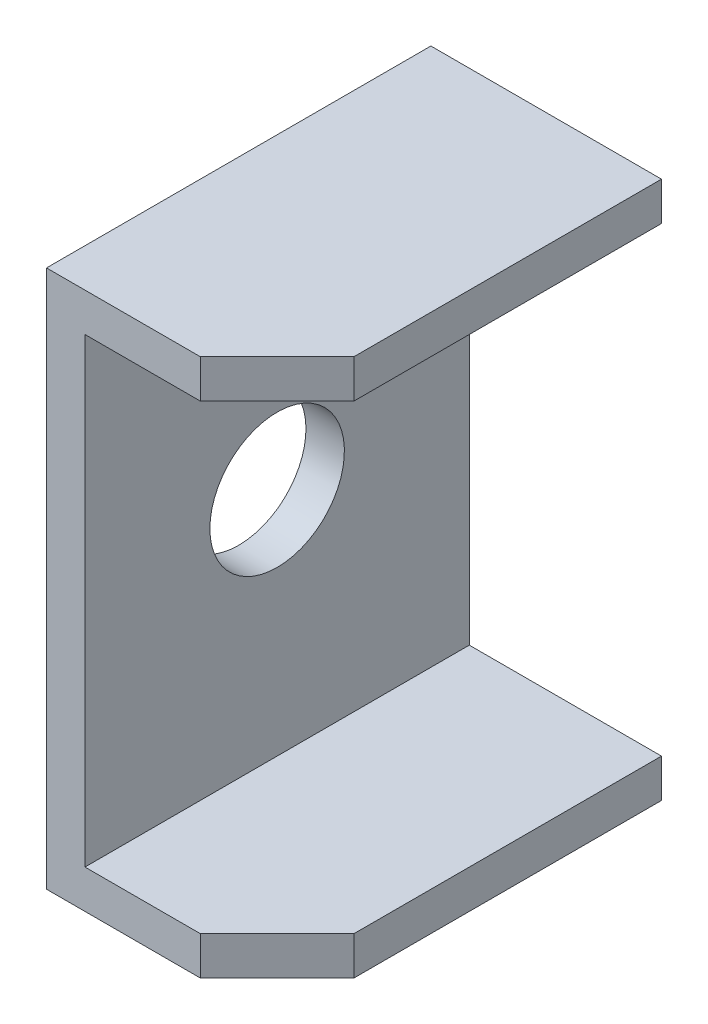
ISO-10303-21;
HEADER;
FILE_DESCRIPTION(('STEP AP214'),'2;1');
FILE_NAME('part.step','',(''),(''),'','','');
FILE_SCHEMA(('AUTOMOTIVE_DESIGN { 1 0 10303 214 1 1 1 1 }'));
ENDSEC;
DATA;
#1=APPLICATION_CONTEXT('core data for automotive mechanical design processes');
#2=APPLICATION_PROTOCOL_DEFINITION('international standard','automotive_design',2000,#1);
#3=PRODUCT_CONTEXT('',#1,'mechanical');
#4=PRODUCT('Part','Part','',(#3));
#5=PRODUCT_RELATED_PRODUCT_CATEGORY('part','',(#4));
#6=PRODUCT_DEFINITION_FORMATION('','',#4);
#7=PRODUCT_DEFINITION_CONTEXT('part definition',#1,'design');
#8=PRODUCT_DEFINITION('design','',#6,#7);
#9=PRODUCT_DEFINITION_SHAPE('','',#8);
#10=(LENGTH_UNIT() NAMED_UNIT(*) SI_UNIT(.MILLI.,.METRE.));
#11=(NAMED_UNIT(*) PLANE_ANGLE_UNIT() SI_UNIT($,.RADIAN.));
#12=(NAMED_UNIT(*) SI_UNIT($,.STERADIAN.) SOLID_ANGLE_UNIT());
#13=UNCERTAINTY_MEASURE_WITH_UNIT(LENGTH_MEASURE(1.E-05),#10,'distance_accuracy_value','');
#14=(GEOMETRIC_REPRESENTATION_CONTEXT(3) GLOBAL_UNCERTAINTY_ASSIGNED_CONTEXT((#13)) GLOBAL_UNIT_ASSIGNED_CONTEXT((#10,
#11,#12)) REPRESENTATION_CONTEXT('',''));
#15=CARTESIAN_POINT('',(0.,0.,0.));
#16=DIRECTION('',(0.,0.,1.));
#17=DIRECTION('',(1.,0.,0.));
#18=AXIS2_PLACEMENT_3D('',#15,#16,#17);
#19=CARTESIAN_POINT('',(0.,0.,100.));
#20=DIRECTION('',(1.,0.,0.));
#21=DIRECTION('',(0.,1.,0.));
#22=AXIS2_PLACEMENT_3D('',#19,#20,#21);
#23=PLANE('',#22);
#24=CARTESIAN_POINT('',(0.,-70.,50.));
#25=DIRECTION('',(-1.,0.,0.));
#26=DIRECTION('',(0.,-1.,0.));
#27=AXIS2_PLACEMENT_3D('',#24,#25,#26);
#28=CIRCLE('',#27,17.5);
#29=CARTESIAN_POINT('',(0.,-87.5,50.));
#30=VERTEX_POINT('',#29);
#31=EDGE_CURVE('E132',#30,#30,#28,.T.);
#32=ORIENTED_EDGE('',*,*,#31,.F.);
#33=EDGE_LOOP('',(#32));
#34=FACE_BOUND('',#33,.T.);
#35=DIRECTION('',(0.,-1.,0.));
#36=VECTOR('',#35,1.);
#37=CARTESIAN_POINT('',(0.,0.,0.));
#38=LINE('',#37,#36);
#39=CARTESIAN_POINT('',(0.,0.,0.));
#40=VERTEX_POINT('',#39);
#41=CARTESIAN_POINT('',(0.,-140.,0.));
#42=VERTEX_POINT('',#41);
#43=EDGE_CURVE('E109',#40,#42,#38,.T.);
#44=ORIENTED_EDGE('',*,*,#43,.T.);
#45=DIRECTION('',(0.,0.,-1.));
#46=VECTOR('',#45,1.);
#47=CARTESIAN_POINT('',(0.,-140.,100.));
#48=LINE('',#47,#46);
#49=CARTESIAN_POINT('',(0.,-140.,100.));
#50=VERTEX_POINT('',#49);
#51=EDGE_CURVE('E116',#50,#42,#48,.T.);
#52=ORIENTED_EDGE('',*,*,#51,.F.);
#53=DIRECTION('',(0.,-1.,0.));
#54=VECTOR('',#53,1.);
#55=CARTESIAN_POINT('',(0.,0.,100.));
#56=LINE('',#55,#54);
#57=CARTESIAN_POINT('',(0.,0.,100.));
#58=VERTEX_POINT('',#57);
#59=EDGE_CURVE('E149',#58,#50,#56,.T.);
#60=ORIENTED_EDGE('',*,*,#59,.F.);
#61=DIRECTION('',(0.,0.,-1.));
#62=VECTOR('',#61,1.);
#63=CARTESIAN_POINT('',(0.,0.,100.));
#64=LINE('',#63,#62);
#65=EDGE_CURVE('E128',#58,#40,#64,.T.);
#66=ORIENTED_EDGE('',*,*,#65,.T.);
#67=EDGE_LOOP('',(#44,#52,#60,#66));
#68=FACE_BOUND('',#67,.T.);
#69=ADVANCED_FACE('F29',(#34,#68),#23,.F.);
#70=CARTESIAN_POINT('',(0.,-140.,100.));
#71=DIRECTION('',(0.,1.,0.));
#72=DIRECTION('',(-1.,0.,0.));
#73=AXIS2_PLACEMENT_3D('',#70,#71,#72);
#74=PLANE('',#73);
#75=DIRECTION('',(0.,0.,-1.));
#76=VECTOR('',#75,1.);
#77=CARTESIAN_POINT('',(60.,-140.,100.));
#78=LINE('',#77,#76);
#79=CARTESIAN_POINT('',(60.,-140.,79.9999999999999));
#80=VERTEX_POINT('',#79);
#81=CARTESIAN_POINT('',(60.,-140.,0.));
#82=VERTEX_POINT('',#81);
#83=EDGE_CURVE('E124',#80,#82,#78,.T.);
#84=ORIENTED_EDGE('',*,*,#83,.F.);
#85=DIRECTION('',(0.707106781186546,0.,-0.707106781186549));
#86=VECTOR('',#85,1.);
#87=CARTESIAN_POINT('',(40.,-140.,100.));
#88=LINE('',#87,#86);
#89=CARTESIAN_POINT('',(40.,-140.,100.));
#90=VERTEX_POINT('',#89);
#91=EDGE_CURVE('E11',#80,#90,#88,.F.);
#92=ORIENTED_EDGE('',*,*,#91,.T.);
#93=DIRECTION('',(1.,0.,0.));
#94=VECTOR('',#93,1.);
#95=CARTESIAN_POINT('',(0.,-140.,100.));
#96=LINE('',#95,#94);
#97=EDGE_CURVE('E119',#50,#90,#96,.T.);
#98=ORIENTED_EDGE('',*,*,#97,.F.);
#99=ORIENTED_EDGE('',*,*,#51,.T.);
#100=DIRECTION('',(1.,0.,0.));
#101=VECTOR('',#100,1.);
#102=CARTESIAN_POINT('',(0.,-140.,0.));
#103=LINE('',#102,#101);
#104=EDGE_CURVE('E104',#42,#82,#103,.T.);
#105=ORIENTED_EDGE('',*,*,#104,.T.);
#106=EDGE_LOOP('',(#84,#92,#98,#99,#105));
#107=FACE_BOUND('',#106,.T.);
#108=ADVANCED_FACE('F117',(#107),#74,.F.);
#109=CARTESIAN_POINT('',(60.,-140.,100.));
#110=DIRECTION('',(-1.,0.,0.));
#111=DIRECTION('',(0.,0.,1.));
#112=AXIS2_PLACEMENT_3D('',#109,#110,#111);
#113=PLANE('',#112);
#114=DIRECTION('',(0.,0.,-1.));
#115=VECTOR('',#114,1.);
#116=CARTESIAN_POINT('',(60.,-130.,100.));
#117=LINE('',#116,#115);
#118=CARTESIAN_POINT('',(60.,-130.,79.9999999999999));
#119=VERTEX_POINT('',#118);
#120=CARTESIAN_POINT('',(60.,-130.,0.));
#121=VERTEX_POINT('',#120);
#122=EDGE_CURVE('E172',#119,#121,#117,.T.);
#123=ORIENTED_EDGE('',*,*,#122,.F.);
#124=DIRECTION('',(0.,-1.,0.));
#125=VECTOR('',#124,1.);
#126=CARTESIAN_POINT('',(60.,-140.,79.9999999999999));
#127=LINE('',#126,#125);
#128=EDGE_CURVE('E36',#119,#80,#127,.T.);
#129=ORIENTED_EDGE('',*,*,#128,.T.);
#130=ORIENTED_EDGE('',*,*,#83,.T.);
#131=DIRECTION('',(0.,1.,0.));
#132=VECTOR('',#131,1.);
#133=CARTESIAN_POINT('',(60.,-140.,0.));
#134=LINE('',#133,#132);
#135=EDGE_CURVE('E112',#82,#121,#134,.T.);
#136=ORIENTED_EDGE('',*,*,#135,.T.);
#137=EDGE_LOOP('',(#123,#129,#130,#136));
#138=FACE_BOUND('',#137,.T.);
#139=ADVANCED_FACE('F211',(#138),#113,.F.);
#140=CARTESIAN_POINT('',(60.,-130.,100.));
#141=DIRECTION('',(0.,-1.,0.));
#142=DIRECTION('',(0.,0.,-1.));
#143=AXIS2_PLACEMENT_3D('',#140,#141,#142);
#144=PLANE('',#143);
#145=DIRECTION('',(-1.,0.,0.));
#146=VECTOR('',#145,1.);
#147=CARTESIAN_POINT('',(60.,-130.,100.));
#148=LINE('',#147,#146);
#149=CARTESIAN_POINT('',(40.,-130.,100.));
#150=VERTEX_POINT('',#149);
#151=CARTESIAN_POINT('',(10.,-130.,100.));
#152=VERTEX_POINT('',#151);
#153=EDGE_CURVE('E152',#150,#152,#148,.T.);
#154=ORIENTED_EDGE('',*,*,#153,.F.);
#155=DIRECTION('',(-0.707106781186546,0.,0.707106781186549));
#156=VECTOR('',#155,1.);
#157=CARTESIAN_POINT('',(40.,-130.,100.));
#158=LINE('',#157,#156);
#159=EDGE_CURVE('E50',#150,#119,#158,.F.);
#160=ORIENTED_EDGE('',*,*,#159,.T.);
#161=ORIENTED_EDGE('',*,*,#122,.T.);
#162=DIRECTION('',(-1.,0.,0.));
#163=VECTOR('',#162,1.);
#164=CARTESIAN_POINT('',(60.,-130.,0.));
#165=LINE('',#164,#163);
#166=CARTESIAN_POINT('',(10.,-130.,0.));
#167=VERTEX_POINT('',#166);
#168=EDGE_CURVE('E137',#121,#167,#165,.T.);
#169=ORIENTED_EDGE('',*,*,#168,.T.);
#170=DIRECTION('',(0.,0.,-1.));
#171=VECTOR('',#170,1.);
#172=CARTESIAN_POINT('',(10.,-130.,100.));
#173=LINE('',#172,#171);
#174=EDGE_CURVE('E169',#152,#167,#173,.T.);
#175=ORIENTED_EDGE('',*,*,#174,.F.);
#176=EDGE_LOOP('',(#154,#160,#161,#169,#175));
#177=FACE_BOUND('',#176,.T.);
#178=ADVANCED_FACE('F214',(#177),#144,.F.);
#179=CARTESIAN_POINT('',(10.,-130.,100.));
#180=DIRECTION('',(-1.,0.,0.));
#181=DIRECTION('',(0.,0.,1.));
#182=AXIS2_PLACEMENT_3D('',#179,#180,#181);
#183=PLANE('',#182);
#184=CARTESIAN_POINT('',(10.,-70.,50.));
#185=DIRECTION('',(-1.,0.,0.));
#186=DIRECTION('',(0.,0.,1.));
#187=AXIS2_PLACEMENT_3D('',#184,#185,#186);
#188=CIRCLE('',#187,17.5);
#189=CARTESIAN_POINT('',(10.,-70.,67.5));
#190=VERTEX_POINT('',#189);
#191=EDGE_CURVE('E129',#190,#190,#188,.T.);
#192=ORIENTED_EDGE('',*,*,#191,.T.);
#193=EDGE_LOOP('',(#192));
#194=FACE_BOUND('',#193,.T.);
#195=DIRECTION('',(0.,1.,0.));
#196=VECTOR('',#195,1.);
#197=CARTESIAN_POINT('',(10.,-130.,0.));
#198=LINE('',#197,#196);
#199=CARTESIAN_POINT('',(10.,-10.,0.));
#200=VERTEX_POINT('',#199);
#201=EDGE_CURVE('E139',#167,#200,#198,.T.);
#202=ORIENTED_EDGE('',*,*,#201,.T.);
#203=DIRECTION('',(0.,0.,-1.));
#204=VECTOR('',#203,1.);
#205=CARTESIAN_POINT('',(10.,-10.,100.));
#206=LINE('',#205,#204);
#207=CARTESIAN_POINT('',(10.,-10.,100.));
#208=VERTEX_POINT('',#207);
#209=EDGE_CURVE('E166',#208,#200,#206,.T.);
#210=ORIENTED_EDGE('',*,*,#209,.F.);
#211=DIRECTION('',(0.,1.,0.));
#212=VECTOR('',#211,1.);
#213=CARTESIAN_POINT('',(10.,-130.,100.));
#214=LINE('',#213,#212);
#215=EDGE_CURVE('E154',#152,#208,#214,.T.);
#216=ORIENTED_EDGE('',*,*,#215,.F.);
#217=ORIENTED_EDGE('',*,*,#174,.T.);
#218=EDGE_LOOP('',(#202,#210,#216,#217));
#219=FACE_BOUND('',#218,.T.);
#220=ADVANCED_FACE('F216',(#194,#219),#183,.F.);
#221=CARTESIAN_POINT('',(10.,-10.,100.));
#222=DIRECTION('',(0.,1.,0.));
#223=DIRECTION('',(-1.,0.,0.));
#224=AXIS2_PLACEMENT_3D('',#221,#222,#223);
#225=PLANE('',#224);
#226=DIRECTION('',(0.,0.,-1.));
#227=VECTOR('',#226,1.);
#228=CARTESIAN_POINT('',(60.,-10.,100.));
#229=LINE('',#228,#227);
#230=CARTESIAN_POINT('',(60.,-10.,79.9999999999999));
#231=VERTEX_POINT('',#230);
#232=CARTESIAN_POINT('',(60.,-10.,0.));
#233=VERTEX_POINT('',#232);
#234=EDGE_CURVE('E164',#231,#233,#229,.T.);
#235=ORIENTED_EDGE('',*,*,#234,.F.);
#236=DIRECTION('',(0.707106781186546,0.,-0.707106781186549));
#237=VECTOR('',#236,1.);
#238=CARTESIAN_POINT('',(40.,-10.,100.));
#239=LINE('',#238,#237);
#240=CARTESIAN_POINT('',(40.,-10.,100.));
#241=VERTEX_POINT('',#240);
#242=EDGE_CURVE('E184',#231,#241,#239,.F.);
#243=ORIENTED_EDGE('',*,*,#242,.T.);
#244=DIRECTION('',(1.,0.,0.));
#245=VECTOR('',#244,1.);
#246=CARTESIAN_POINT('',(10.,-10.,100.));
#247=LINE('',#246,#245);
#248=EDGE_CURVE('E156',#208,#241,#247,.T.);
#249=ORIENTED_EDGE('',*,*,#248,.F.);
#250=ORIENTED_EDGE('',*,*,#209,.T.);
#251=DIRECTION('',(1.,0.,0.));
#252=VECTOR('',#251,1.);
#253=CARTESIAN_POINT('',(10.,-10.,0.));
#254=LINE('',#253,#252);
#255=EDGE_CURVE('E141',#200,#233,#254,.T.);
#256=ORIENTED_EDGE('',*,*,#255,.T.);
#257=EDGE_LOOP('',(#235,#243,#249,#250,#256));
#258=FACE_BOUND('',#257,.T.);
#259=ADVANCED_FACE('F190',(#258),#225,.F.);
#260=CARTESIAN_POINT('',(60.,-10.,100.));
#261=DIRECTION('',(-1.,0.,0.));
#262=DIRECTION('',(0.,0.,1.));
#263=AXIS2_PLACEMENT_3D('',#260,#261,#262);
#264=PLANE('',#263);
#265=DIRECTION('',(0.,0.,-1.));
#266=VECTOR('',#265,1.);
#267=CARTESIAN_POINT('',(60.,0.,100.));
#268=LINE('',#267,#266);
#269=CARTESIAN_POINT('',(60.,0.,79.9999999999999));
#270=VERTEX_POINT('',#269);
#271=CARTESIAN_POINT('',(60.,0.,0.));
#272=VERTEX_POINT('',#271);
#273=EDGE_CURVE('E162',#270,#272,#268,.T.);
#274=ORIENTED_EDGE('',*,*,#273,.F.);
#275=DIRECTION('',(0.,-1.,0.));
#276=VECTOR('',#275,1.);
#277=CARTESIAN_POINT('',(60.,-10.,79.9999999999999));
#278=LINE('',#277,#276);
#279=EDGE_CURVE('E182',#270,#231,#278,.T.);
#280=ORIENTED_EDGE('',*,*,#279,.T.);
#281=ORIENTED_EDGE('',*,*,#234,.T.);
#282=DIRECTION('',(0.,1.,0.));
#283=VECTOR('',#282,1.);
#284=CARTESIAN_POINT('',(60.,-10.,0.));
#285=LINE('',#284,#283);
#286=EDGE_CURVE('E144',#233,#272,#285,.T.);
#287=ORIENTED_EDGE('',*,*,#286,.T.);
#288=EDGE_LOOP('',(#274,#280,#281,#287));
#289=FACE_BOUND('',#288,.T.);
#290=ADVANCED_FACE('F204',(#289),#264,.F.);
#291=CARTESIAN_POINT('',(0.,0.,100.));
#292=DIRECTION('',(0.,-1.,0.));
#293=DIRECTION('',(0.,0.,-1.));
#294=AXIS2_PLACEMENT_3D('',#291,#292,#293);
#295=PLANE('',#294);
#296=DIRECTION('',(-1.,0.,0.));
#297=VECTOR('',#296,1.);
#298=CARTESIAN_POINT('',(0.,0.,100.));
#299=LINE('',#298,#297);
#300=CARTESIAN_POINT('',(40.,0.,100.));
#301=VERTEX_POINT('',#300);
#302=EDGE_CURVE('E159',#301,#58,#299,.T.);
#303=ORIENTED_EDGE('',*,*,#302,.F.);
#304=DIRECTION('',(-0.707106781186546,0.,0.707106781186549));
#305=VECTOR('',#304,1.);
#306=CARTESIAN_POINT('',(40.,0.,100.));
#307=LINE('',#306,#305);
#308=EDGE_CURVE('E180',#301,#270,#307,.F.);
#309=ORIENTED_EDGE('',*,*,#308,.T.);
#310=ORIENTED_EDGE('',*,*,#273,.T.);
#311=DIRECTION('',(-1.,0.,0.));
#312=VECTOR('',#311,1.);
#313=CARTESIAN_POINT('',(0.,0.,0.));
#314=LINE('',#313,#312);
#315=EDGE_CURVE('E147',#272,#40,#314,.T.);
#316=ORIENTED_EDGE('',*,*,#315,.T.);
#317=ORIENTED_EDGE('',*,*,#65,.F.);
#318=EDGE_LOOP('',(#303,#309,#310,#316,#317));
#319=FACE_BOUND('',#318,.T.);
#320=ADVANCED_FACE('F202',(#319),#295,.F.);
#321=CARTESIAN_POINT('',(0.,-130.,100.));
#322=DIRECTION('',(0.,0.,-1.));
#323=DIRECTION('',(-1.,0.,0.));
#324=AXIS2_PLACEMENT_3D('',#321,#322,#323);
#325=PLANE('',#324);
#326=ORIENTED_EDGE('',*,*,#248,.T.);
#327=DIRECTION('',(0.,1.,0.));
#328=VECTOR('',#327,1.);
#329=CARTESIAN_POINT('',(40.,-130.,100.));
#330=LINE('',#329,#328);
#331=EDGE_CURVE('E177',#241,#301,#330,.T.);
#332=ORIENTED_EDGE('',*,*,#331,.T.);
#333=ORIENTED_EDGE('',*,*,#302,.T.);
#334=ORIENTED_EDGE('',*,*,#59,.T.);
#335=ORIENTED_EDGE('',*,*,#97,.T.);
#336=DIRECTION('',(0.,1.,0.));
#337=VECTOR('',#336,1.);
#338=CARTESIAN_POINT('',(40.,-130.,100.));
#339=LINE('',#338,#337);
#340=EDGE_CURVE('E123',#90,#150,#339,.T.);
#341=ORIENTED_EDGE('',*,*,#340,.T.);
#342=ORIENTED_EDGE('',*,*,#153,.T.);
#343=ORIENTED_EDGE('',*,*,#215,.T.);
#344=EDGE_LOOP('',(#326,#332,#333,#334,#335,#341,#342,#343));
#345=FACE_BOUND('',#344,.T.);
#346=ADVANCED_FACE('F195',(#345),#325,.F.);
#347=CARTESIAN_POINT('',(0.,-130.,0.));
#348=DIRECTION('',(0.,0.,-1.));
#349=DIRECTION('',(-1.,0.,0.));
#350=AXIS2_PLACEMENT_3D('',#347,#348,#349);
#351=PLANE('',#350);
#352=ORIENTED_EDGE('',*,*,#43,.F.);
#353=ORIENTED_EDGE('',*,*,#315,.F.);
#354=ORIENTED_EDGE('',*,*,#286,.F.);
#355=ORIENTED_EDGE('',*,*,#255,.F.);
#356=ORIENTED_EDGE('',*,*,#201,.F.);
#357=ORIENTED_EDGE('',*,*,#168,.F.);
#358=ORIENTED_EDGE('',*,*,#135,.F.);
#359=ORIENTED_EDGE('',*,*,#104,.F.);
#360=EDGE_LOOP('',(#352,#353,#354,#355,#356,#357,#358,#359));
#361=FACE_BOUND('',#360,.T.);
#362=ADVANCED_FACE('F106',(#361),#351,.T.);
#363=CARTESIAN_POINT('',(20.,-70.,50.));
#364=DIRECTION('',(-1.,0.,0.));
#365=DIRECTION('',(0.,-1.,0.));
#366=AXIS2_PLACEMENT_3D('',#363,#364,#365);
#367=CYLINDRICAL_SURFACE('',#366,17.5);
#368=ORIENTED_EDGE('',*,*,#31,.T.);
#369=EDGE_LOOP('',(#368));
#370=FACE_BOUND('',#369,.T.);
#371=ORIENTED_EDGE('',*,*,#191,.F.);
#372=EDGE_LOOP('',(#371));
#373=FACE_BOUND('',#372,.T.);
#374=ADVANCED_FACE('F234',(#370,#373),#367,.F.);
#375=CARTESIAN_POINT('',(40.,-130.,100.));
#376=DIRECTION('',(-0.707106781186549,0.,-0.707106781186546));
#377=DIRECTION('',(-0.707106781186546,0.,0.707106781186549));
#378=AXIS2_PLACEMENT_3D('',#375,#376,#377);
#379=PLANE('',#378);
#380=ORIENTED_EDGE('',*,*,#242,.F.);
#381=ORIENTED_EDGE('',*,*,#279,.F.);
#382=ORIENTED_EDGE('',*,*,#308,.F.);
#383=ORIENTED_EDGE('',*,*,#331,.F.);
#384=EDGE_LOOP('',(#380,#381,#382,#383));
#385=FACE_BOUND('',#384,.T.);
#386=ADVANCED_FACE('F199',(#385),#379,.F.);
#387=CARTESIAN_POINT('',(40.,-130.,100.));
#388=DIRECTION('',(-0.707106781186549,0.,-0.707106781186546));
#389=DIRECTION('',(-0.707106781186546,0.,0.707106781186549));
#390=AXIS2_PLACEMENT_3D('',#387,#388,#389);
#391=PLANE('',#390);
#392=ORIENTED_EDGE('',*,*,#91,.F.);
#393=ORIENTED_EDGE('',*,*,#128,.F.);
#394=ORIENTED_EDGE('',*,*,#159,.F.);
#395=ORIENTED_EDGE('',*,*,#340,.F.);
#396=EDGE_LOOP('',(#392,#393,#394,#395));
#397=FACE_BOUND('',#396,.T.);
#398=ADVANCED_FACE('F210',(#397),#391,.F.);
#399=CLOSED_SHELL('',(#69,#108,#139,#178,#220,#259,#290,#320,#346,#362,#374,#386,#398));
#400=MANIFOLD_SOLID_BREP('B2',#399);
#401=ADVANCED_BREP_SHAPE_REPRESENTATION('',(#18,#400),#14);
#402=SHAPE_DEFINITION_REPRESENTATION(#9,#401);
ENDSEC;
END-ISO-10303-21;
